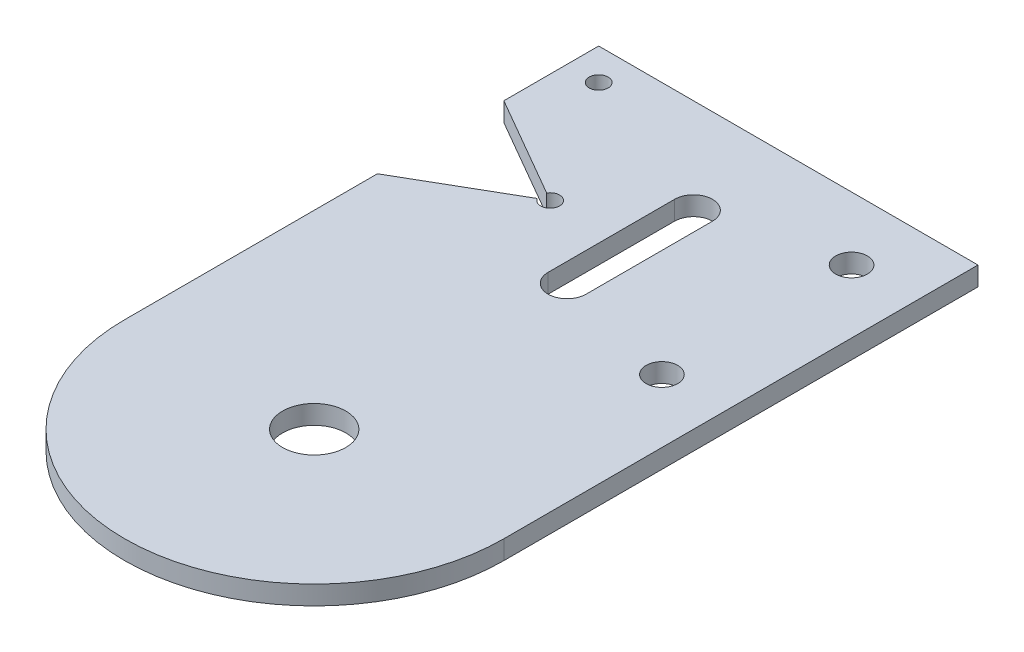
ISO-10303-21;
HEADER;
FILE_DESCRIPTION(('STEP AP214'),'2;1');
FILE_NAME('part.step','',(''),(''),'','','');
FILE_SCHEMA(('AUTOMOTIVE_DESIGN { 1 0 10303 214 1 1 1 1 }'));
ENDSEC;
DATA;
#1=APPLICATION_CONTEXT('core data for automotive mechanical design processes');
#2=APPLICATION_PROTOCOL_DEFINITION('international standard','automotive_design',2000,#1);
#3=PRODUCT_CONTEXT('',#1,'mechanical');
#4=PRODUCT('Part','Part','',(#3));
#5=PRODUCT_RELATED_PRODUCT_CATEGORY('part','',(#4));
#6=PRODUCT_DEFINITION_FORMATION('','',#4);
#7=PRODUCT_DEFINITION_CONTEXT('part definition',#1,'design');
#8=PRODUCT_DEFINITION('design','',#6,#7);
#9=PRODUCT_DEFINITION_SHAPE('','',#8);
#10=(LENGTH_UNIT() NAMED_UNIT(*) SI_UNIT(.MILLI.,.METRE.));
#11=(NAMED_UNIT(*) PLANE_ANGLE_UNIT() SI_UNIT($,.RADIAN.));
#12=(NAMED_UNIT(*) SI_UNIT($,.STERADIAN.) SOLID_ANGLE_UNIT());
#13=UNCERTAINTY_MEASURE_WITH_UNIT(LENGTH_MEASURE(1.E-05),#10,'distance_accuracy_value','');
#14=(GEOMETRIC_REPRESENTATION_CONTEXT(3) GLOBAL_UNCERTAINTY_ASSIGNED_CONTEXT((#13)) GLOBAL_UNIT_ASSIGNED_CONTEXT((#10,
#11,#12)) REPRESENTATION_CONTEXT('',''));
#15=CARTESIAN_POINT('',(0.,0.,0.));
#16=DIRECTION('',(0.,0.,1.));
#17=DIRECTION('',(1.,0.,0.));
#18=AXIS2_PLACEMENT_3D('',#15,#16,#17);
#19=CARTESIAN_POINT('',(17.3205080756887,3.,-80.));
#20=DIRECTION('',(0.,1.,0.));
#21=DIRECTION('',(0.,0.,1.));
#22=AXIS2_PLACEMENT_3D('',#19,#20,#21);
#23=PLANE('',#22);
#24=CARTESIAN_POINT('',(50.,3.,-95.));
#25=DIRECTION('',(0.,1.,0.));
#26=DIRECTION('',(0.,0.,1.));
#27=AXIS2_PLACEMENT_3D('',#24,#25,#26);
#28=CIRCLE('',#27,2.5);
#29=CARTESIAN_POINT('',(50.,3.,-92.5));
#30=VERTEX_POINT('',#29);
#31=EDGE_CURVE('E321',#30,#30,#28,.T.);
#32=ORIENTED_EDGE('',*,*,#31,.F.);
#33=EDGE_LOOP('',(#32));
#34=FACE_BOUND('',#33,.T.);
#35=CARTESIAN_POINT('',(30.,3.,-30.));
#36=DIRECTION('',(0.,1.,0.));
#37=DIRECTION('',(0.,0.,1.));
#38=AXIS2_PLACEMENT_3D('',#35,#36,#37);
#39=CIRCLE('',#38,5.);
#40=CARTESIAN_POINT('',(30.,3.,-25.));
#41=VERTEX_POINT('',#40);
#42=EDGE_CURVE('E143',#41,#41,#39,.T.);
#43=ORIENTED_EDGE('',*,*,#42,.F.);
#44=EDGE_LOOP('',(#43));
#45=FACE_BOUND('',#44,.T.);
#46=DIRECTION('',(0.,0.,-1.));
#47=VECTOR('',#46,1.);
#48=CARTESIAN_POINT('',(60.,3.,-30.));
#49=LINE('',#48,#47);
#50=CARTESIAN_POINT('',(60.,3.,-30.));
#51=VERTEX_POINT('',#50);
#52=CARTESIAN_POINT('',(60.,3.,-105.));
#53=VERTEX_POINT('',#52);
#54=EDGE_CURVE('E179',#51,#53,#49,.T.);
#55=ORIENTED_EDGE('',*,*,#54,.T.);
#56=DIRECTION('',(-1.,0.,0.));
#57=VECTOR('',#56,1.);
#58=CARTESIAN_POINT('',(0.,3.,-105.));
#59=LINE('',#58,#57);
#60=CARTESIAN_POINT('',(0.,3.,-105.));
#61=VERTEX_POINT('',#60);
#62=EDGE_CURVE('E182',#53,#61,#59,.T.);
#63=ORIENTED_EDGE('',*,*,#62,.T.);
#64=DIRECTION('',(0.,0.,1.));
#65=VECTOR('',#64,1.);
#66=CARTESIAN_POINT('',(0.,3.,-90.));
#67=LINE('',#66,#65);
#68=CARTESIAN_POINT('',(0.,3.,-90.));
#69=VERTEX_POINT('',#68);
#70=EDGE_CURVE('E184',#61,#69,#67,.T.);
#71=ORIENTED_EDGE('',*,*,#70,.T.);
#72=DIRECTION('',(0.866025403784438,0.,0.500000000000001));
#73=VECTOR('',#72,1.);
#74=CARTESIAN_POINT('',(0.,3.,-90.));
#75=LINE('',#74,#73);
#76=CARTESIAN_POINT('',(16.0214699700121,3.,-80.75));
#77=VERTEX_POINT('',#76);
#78=EDGE_CURVE('E186',#69,#77,#75,.T.);
#79=ORIENTED_EDGE('',*,*,#78,.T.);
#80=CARTESIAN_POINT('',(17.3205080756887,3.,-80.));
#81=DIRECTION('',(0.,-1.,0.));
#82=DIRECTION('',(0.,0.,1.));
#83=AXIS2_PLACEMENT_3D('',#80,#81,#82);
#84=CIRCLE('',#83,1.49999999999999);
#85=CARTESIAN_POINT('',(16.0214699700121,3.,-79.25));
#86=VERTEX_POINT('',#85);
#87=EDGE_CURVE('E188',#77,#86,#84,.T.);
#88=ORIENTED_EDGE('',*,*,#87,.T.);
#89=DIRECTION('',(-0.866025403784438,0.,0.500000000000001));
#90=VECTOR('',#89,1.);
#91=CARTESIAN_POINT('',(0.,3.,-70.));
#92=LINE('',#91,#90);
#93=CARTESIAN_POINT('',(0.,3.,-70.));
#94=VERTEX_POINT('',#93);
#95=EDGE_CURVE('E190',#86,#94,#92,.T.);
#96=ORIENTED_EDGE('',*,*,#95,.T.);
#97=DIRECTION('',(0.,0.,1.));
#98=VECTOR('',#97,1.);
#99=CARTESIAN_POINT('',(0.,3.,-30.));
#100=LINE('',#99,#98);
#101=CARTESIAN_POINT('',(0.,3.,-30.));
#102=VERTEX_POINT('',#101);
#103=EDGE_CURVE('E192',#94,#102,#100,.T.);
#104=ORIENTED_EDGE('',*,*,#103,.T.);
#105=CARTESIAN_POINT('',(30.,3.,-30.));
#106=DIRECTION('',(0.,1.,0.));
#107=DIRECTION('',(0.,0.,1.));
#108=AXIS2_PLACEMENT_3D('',#105,#106,#107);
#109=CIRCLE('',#108,30.);
#110=EDGE_CURVE('E194',#102,#51,#109,.T.);
#111=ORIENTED_EDGE('',*,*,#110,.T.);
#112=EDGE_LOOP('',(#55,#63,#71,#79,#88,#96,#104,#111));
#113=FACE_BOUND('',#112,.T.);
#114=DIRECTION('',(0.,0.,1.));
#115=VECTOR('',#114,1.);
#116=CARTESIAN_POINT('',(27.,3.,-70.));
#117=LINE('',#116,#115);
#118=CARTESIAN_POINT('',(27.,3.,-90.));
#119=VERTEX_POINT('',#118);
#120=CARTESIAN_POINT('',(27.,3.,-70.));
#121=VERTEX_POINT('',#120);
#122=EDGE_CURVE('E153',#119,#121,#117,.T.);
#123=ORIENTED_EDGE('',*,*,#122,.F.);
#124=CARTESIAN_POINT('',(30.,3.,-90.));
#125=DIRECTION('',(0.,1.,0.));
#126=DIRECTION('',(0.,0.,1.));
#127=AXIS2_PLACEMENT_3D('',#124,#125,#126);
#128=CIRCLE('',#127,3.);
#129=CARTESIAN_POINT('',(33.,3.,-90.));
#130=VERTEX_POINT('',#129);
#131=EDGE_CURVE('E136',#130,#119,#128,.T.);
#132=ORIENTED_EDGE('',*,*,#131,.F.);
#133=DIRECTION('',(0.,0.,-1.));
#134=VECTOR('',#133,1.);
#135=CARTESIAN_POINT('',(33.,3.,-70.));
#136=LINE('',#135,#134);
#137=CARTESIAN_POINT('',(33.,3.,-70.));
#138=VERTEX_POINT('',#137);
#139=EDGE_CURVE('E157',#138,#130,#136,.T.);
#140=ORIENTED_EDGE('',*,*,#139,.F.);
#141=CARTESIAN_POINT('',(30.,3.,-70.));
#142=DIRECTION('',(0.,1.,0.));
#143=DIRECTION('',(0.,0.,1.));
#144=AXIS2_PLACEMENT_3D('',#141,#142,#143);
#145=CIRCLE('',#144,3.);
#146=EDGE_CURVE('E155',#121,#138,#145,.T.);
#147=ORIENTED_EDGE('',*,*,#146,.F.);
#148=EDGE_LOOP('',(#123,#132,#140,#147));
#149=FACE_BOUND('',#148,.T.);
#150=CARTESIAN_POINT('',(5.,3.,-100.));
#151=DIRECTION('',(0.,1.,0.));
#152=DIRECTION('',(0.,0.,1.));
#153=AXIS2_PLACEMENT_3D('',#150,#151,#152);
#154=CIRCLE('',#153,1.5);
#155=CARTESIAN_POINT('',(5.,3.,-98.5));
#156=VERTEX_POINT('',#155);
#157=EDGE_CURVE('E327',#156,#156,#154,.T.);
#158=ORIENTED_EDGE('',*,*,#157,.F.);
#159=EDGE_LOOP('',(#158));
#160=FACE_BOUND('',#159,.T.);
#161=CARTESIAN_POINT('',(50.,3.,-65.));
#162=DIRECTION('',(0.,1.,0.));
#163=DIRECTION('',(0.,0.,1.));
#164=AXIS2_PLACEMENT_3D('',#161,#162,#163);
#165=CIRCLE('',#164,2.5);
#166=CARTESIAN_POINT('',(50.,3.,-62.5));
#167=VERTEX_POINT('',#166);
#168=EDGE_CURVE('E310',#167,#167,#165,.T.);
#169=ORIENTED_EDGE('',*,*,#168,.F.);
#170=EDGE_LOOP('',(#169));
#171=FACE_BOUND('',#170,.T.);
#172=ADVANCED_FACE('F32',(#34,#45,#113,#149,#160,#171),#23,.T.);
#173=CARTESIAN_POINT('',(17.3205080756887,0.,-80.));
#174=DIRECTION('',(0.,1.,0.));
#175=DIRECTION('',(0.,0.,1.));
#176=AXIS2_PLACEMENT_3D('',#173,#174,#175);
#177=PLANE('',#176);
#178=CARTESIAN_POINT('',(50.,0.,-95.));
#179=DIRECTION('',(0.,1.,0.));
#180=DIRECTION('',(0.,0.,1.));
#181=AXIS2_PLACEMENT_3D('',#178,#179,#180);
#182=CIRCLE('',#181,2.5);
#183=CARTESIAN_POINT('',(50.,0.,-92.5));
#184=VERTEX_POINT('',#183);
#185=EDGE_CURVE('E316',#184,#184,#182,.T.);
#186=ORIENTED_EDGE('',*,*,#185,.T.);
#187=EDGE_LOOP('',(#186));
#188=FACE_BOUND('',#187,.T.);
#189=CARTESIAN_POINT('',(30.,0.,-30.));
#190=DIRECTION('',(0.,1.,0.));
#191=DIRECTION('',(0.,0.,1.));
#192=AXIS2_PLACEMENT_3D('',#189,#190,#191);
#193=CIRCLE('',#192,5.);
#194=CARTESIAN_POINT('',(30.,0.,-25.));
#195=VERTEX_POINT('',#194);
#196=EDGE_CURVE('E146',#195,#195,#193,.T.);
#197=ORIENTED_EDGE('',*,*,#196,.T.);
#198=EDGE_LOOP('',(#197));
#199=FACE_BOUND('',#198,.T.);
#200=DIRECTION('',(0.,0.,-1.));
#201=VECTOR('',#200,1.);
#202=CARTESIAN_POINT('',(60.,0.,-30.));
#203=LINE('',#202,#201);
#204=CARTESIAN_POINT('',(60.,0.,-30.));
#205=VERTEX_POINT('',#204);
#206=CARTESIAN_POINT('',(60.,0.,-105.));
#207=VERTEX_POINT('',#206);
#208=EDGE_CURVE('E137',#205,#207,#203,.T.);
#209=ORIENTED_EDGE('',*,*,#208,.F.);
#210=CARTESIAN_POINT('',(30.,0.,-30.));
#211=DIRECTION('',(0.,1.,0.));
#212=DIRECTION('',(0.,0.,1.));
#213=AXIS2_PLACEMENT_3D('',#210,#211,#212);
#214=CIRCLE('',#213,30.);
#215=CARTESIAN_POINT('',(0.,0.,-30.));
#216=VERTEX_POINT('',#215);
#217=EDGE_CURVE('E177',#216,#205,#214,.T.);
#218=ORIENTED_EDGE('',*,*,#217,.F.);
#219=DIRECTION('',(0.,0.,1.));
#220=VECTOR('',#219,1.);
#221=CARTESIAN_POINT('',(0.,0.,-30.));
#222=LINE('',#221,#220);
#223=CARTESIAN_POINT('',(0.,0.,-70.));
#224=VERTEX_POINT('',#223);
#225=EDGE_CURVE('E175',#224,#216,#222,.T.);
#226=ORIENTED_EDGE('',*,*,#225,.F.);
#227=DIRECTION('',(-0.866025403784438,0.,0.500000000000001));
#228=VECTOR('',#227,1.);
#229=CARTESIAN_POINT('',(0.,0.,-70.));
#230=LINE('',#229,#228);
#231=CARTESIAN_POINT('',(16.0214699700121,0.,-79.25));
#232=VERTEX_POINT('',#231);
#233=EDGE_CURVE('E173',#232,#224,#230,.T.);
#234=ORIENTED_EDGE('',*,*,#233,.F.);
#235=CARTESIAN_POINT('',(17.3205080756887,0.,-80.));
#236=DIRECTION('',(0.,-1.,0.));
#237=DIRECTION('',(0.,0.,1.));
#238=AXIS2_PLACEMENT_3D('',#235,#236,#237);
#239=CIRCLE('',#238,1.49999999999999);
#240=CARTESIAN_POINT('',(16.0214699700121,0.,-80.75));
#241=VERTEX_POINT('',#240);
#242=EDGE_CURVE('E171',#241,#232,#239,.T.);
#243=ORIENTED_EDGE('',*,*,#242,.F.);
#244=DIRECTION('',(0.866025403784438,0.,0.500000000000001));
#245=VECTOR('',#244,1.);
#246=CARTESIAN_POINT('',(0.,0.,-90.));
#247=LINE('',#246,#245);
#248=CARTESIAN_POINT('',(0.,0.,-90.));
#249=VERTEX_POINT('',#248);
#250=EDGE_CURVE('E169',#249,#241,#247,.T.);
#251=ORIENTED_EDGE('',*,*,#250,.F.);
#252=DIRECTION('',(0.,0.,1.));
#253=VECTOR('',#252,1.);
#254=CARTESIAN_POINT('',(0.,0.,-90.));
#255=LINE('',#254,#253);
#256=CARTESIAN_POINT('',(0.,0.,-105.));
#257=VERTEX_POINT('',#256);
#258=EDGE_CURVE('E167',#257,#249,#255,.T.);
#259=ORIENTED_EDGE('',*,*,#258,.F.);
#260=DIRECTION('',(-1.,0.,0.));
#261=VECTOR('',#260,1.);
#262=CARTESIAN_POINT('',(0.,0.,-105.));
#263=LINE('',#262,#261);
#264=EDGE_CURVE('E165',#207,#257,#263,.T.);
#265=ORIENTED_EDGE('',*,*,#264,.F.);
#266=EDGE_LOOP('',(#209,#218,#226,#234,#243,#251,#259,#265));
#267=FACE_BOUND('',#266,.T.);
#268=CARTESIAN_POINT('',(30.,0.,-90.));
#269=DIRECTION('',(0.,1.,0.));
#270=DIRECTION('',(0.,0.,1.));
#271=AXIS2_PLACEMENT_3D('',#268,#269,#270);
#272=CIRCLE('',#271,3.);
#273=CARTESIAN_POINT('',(33.,0.,-90.));
#274=VERTEX_POINT('',#273);
#275=CARTESIAN_POINT('',(27.,0.,-90.));
#276=VERTEX_POINT('',#275);
#277=EDGE_CURVE('E55',#274,#276,#272,.T.);
#278=ORIENTED_EDGE('',*,*,#277,.T.);
#279=DIRECTION('',(0.,0.,1.));
#280=VECTOR('',#279,1.);
#281=CARTESIAN_POINT('',(27.,0.,-70.));
#282=LINE('',#281,#280);
#283=CARTESIAN_POINT('',(27.,0.,-70.));
#284=VERTEX_POINT('',#283);
#285=EDGE_CURVE('E123',#276,#284,#282,.T.);
#286=ORIENTED_EDGE('',*,*,#285,.T.);
#287=CARTESIAN_POINT('',(30.,0.,-70.));
#288=DIRECTION('',(0.,1.,0.));
#289=DIRECTION('',(0.,0.,1.));
#290=AXIS2_PLACEMENT_3D('',#287,#288,#289);
#291=CIRCLE('',#290,3.);
#292=CARTESIAN_POINT('',(33.,0.,-70.));
#293=VERTEX_POINT('',#292);
#294=EDGE_CURVE('E132',#284,#293,#291,.T.);
#295=ORIENTED_EDGE('',*,*,#294,.T.);
#296=DIRECTION('',(0.,0.,-1.));
#297=VECTOR('',#296,1.);
#298=CARTESIAN_POINT('',(33.,0.,-70.));
#299=LINE('',#298,#297);
#300=EDGE_CURVE('E142',#293,#274,#299,.T.);
#301=ORIENTED_EDGE('',*,*,#300,.T.);
#302=EDGE_LOOP('',(#278,#286,#295,#301));
#303=FACE_BOUND('',#302,.T.);
#304=CARTESIAN_POINT('',(5.,0.,-100.));
#305=DIRECTION('',(0.,1.,0.));
#306=DIRECTION('',(0.,0.,1.));
#307=AXIS2_PLACEMENT_3D('',#304,#305,#306);
#308=CIRCLE('',#307,1.5);
#309=CARTESIAN_POINT('',(5.,0.,-98.5));
#310=VERTEX_POINT('',#309);
#311=EDGE_CURVE('E324',#310,#310,#308,.T.);
#312=ORIENTED_EDGE('',*,*,#311,.T.);
#313=EDGE_LOOP('',(#312));
#314=FACE_BOUND('',#313,.T.);
#315=CARTESIAN_POINT('',(50.,0.,-65.));
#316=DIRECTION('',(0.,1.,0.));
#317=DIRECTION('',(0.,0.,1.));
#318=AXIS2_PLACEMENT_3D('',#315,#316,#317);
#319=CIRCLE('',#318,2.5);
#320=CARTESIAN_POINT('',(50.,0.,-62.5));
#321=VERTEX_POINT('',#320);
#322=EDGE_CURVE('E313',#321,#321,#319,.T.);
#323=ORIENTED_EDGE('',*,*,#322,.T.);
#324=EDGE_LOOP('',(#323));
#325=FACE_BOUND('',#324,.T.);
#326=ADVANCED_FACE('F140',(#188,#199,#267,#303,#314,#325),#177,.F.);
#327=CARTESIAN_POINT('',(60.,3.,-30.));
#328=DIRECTION('',(-1.,0.,0.));
#329=DIRECTION('',(0.,0.,1.));
#330=AXIS2_PLACEMENT_3D('',#327,#328,#329);
#331=PLANE('',#330);
#332=ORIENTED_EDGE('',*,*,#208,.T.);
#333=DIRECTION('',(0.,-1.,0.));
#334=VECTOR('',#333,1.);
#335=CARTESIAN_POINT('',(60.,3.,-105.));
#336=LINE('',#335,#334);
#337=EDGE_CURVE('E11',#53,#207,#336,.T.);
#338=ORIENTED_EDGE('',*,*,#337,.F.);
#339=ORIENTED_EDGE('',*,*,#54,.F.);
#340=DIRECTION('',(0.,-1.,0.));
#341=VECTOR('',#340,1.);
#342=CARTESIAN_POINT('',(60.,3.,-30.));
#343=LINE('',#342,#341);
#344=EDGE_CURVE('E196',#51,#205,#343,.T.);
#345=ORIENTED_EDGE('',*,*,#344,.T.);
#346=EDGE_LOOP('',(#332,#338,#339,#345));
#347=FACE_BOUND('',#346,.T.);
#348=ADVANCED_FACE('F34',(#347),#331,.F.);
#349=CARTESIAN_POINT('',(0.,3.,-105.));
#350=DIRECTION('',(0.,0.,1.));
#351=DIRECTION('',(1.,0.,0.));
#352=AXIS2_PLACEMENT_3D('',#349,#350,#351);
#353=PLANE('',#352);
#354=ORIENTED_EDGE('',*,*,#264,.T.);
#355=DIRECTION('',(0.,-1.,0.));
#356=VECTOR('',#355,1.);
#357=CARTESIAN_POINT('',(0.,3.,-105.));
#358=LINE('',#357,#356);
#359=EDGE_CURVE('E40',#61,#257,#358,.T.);
#360=ORIENTED_EDGE('',*,*,#359,.F.);
#361=ORIENTED_EDGE('',*,*,#62,.F.);
#362=ORIENTED_EDGE('',*,*,#337,.T.);
#363=EDGE_LOOP('',(#354,#360,#361,#362));
#364=FACE_BOUND('',#363,.T.);
#365=ADVANCED_FACE('F240',(#364),#353,.F.);
#366=CARTESIAN_POINT('',(0.,3.,-90.));
#367=DIRECTION('',(1.,0.,0.));
#368=DIRECTION('',(0.,0.,-1.));
#369=AXIS2_PLACEMENT_3D('',#366,#367,#368);
#370=PLANE('',#369);
#371=ORIENTED_EDGE('',*,*,#258,.T.);
#372=DIRECTION('',(0.,-1.,0.));
#373=VECTOR('',#372,1.);
#374=CARTESIAN_POINT('',(0.,3.,-90.));
#375=LINE('',#374,#373);
#376=EDGE_CURVE('E211',#69,#249,#375,.T.);
#377=ORIENTED_EDGE('',*,*,#376,.F.);
#378=ORIENTED_EDGE('',*,*,#70,.F.);
#379=ORIENTED_EDGE('',*,*,#359,.T.);
#380=EDGE_LOOP('',(#371,#377,#378,#379));
#381=FACE_BOUND('',#380,.T.);
#382=ADVANCED_FACE('F218',(#381),#370,.F.);
#383=CARTESIAN_POINT('',(0.,3.,-90.));
#384=DIRECTION('',(0.500000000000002,0.,-0.866025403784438));
#385=DIRECTION('',(-0.866025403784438,0.,-0.500000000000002));
#386=AXIS2_PLACEMENT_3D('',#383,#384,#385);
#387=PLANE('',#386);
#388=ORIENTED_EDGE('',*,*,#250,.T.);
#389=DIRECTION('',(0.,-1.,0.));
#390=VECTOR('',#389,1.);
#391=CARTESIAN_POINT('',(16.0214699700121,3.,-80.75));
#392=LINE('',#391,#390);
#393=EDGE_CURVE('E208',#77,#241,#392,.T.);
#394=ORIENTED_EDGE('',*,*,#393,.F.);
#395=ORIENTED_EDGE('',*,*,#78,.F.);
#396=ORIENTED_EDGE('',*,*,#376,.T.);
#397=EDGE_LOOP('',(#388,#394,#395,#396));
#398=FACE_BOUND('',#397,.T.);
#399=ADVANCED_FACE('F228',(#398),#387,.F.);
#400=CARTESIAN_POINT('',(17.3205080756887,3.,-80.));
#401=DIRECTION('',(0.,-1.,0.));
#402=DIRECTION('',(0.,0.,-1.));
#403=AXIS2_PLACEMENT_3D('',#400,#401,#402);
#404=CYLINDRICAL_SURFACE('',#403,1.49999999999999);
#405=ORIENTED_EDGE('',*,*,#242,.T.);
#406=DIRECTION('',(0.,-1.,0.));
#407=VECTOR('',#406,1.);
#408=CARTESIAN_POINT('',(16.0214699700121,3.,-79.25));
#409=LINE('',#408,#407);
#410=EDGE_CURVE('E205',#86,#232,#409,.T.);
#411=ORIENTED_EDGE('',*,*,#410,.F.);
#412=ORIENTED_EDGE('',*,*,#87,.F.);
#413=ORIENTED_EDGE('',*,*,#393,.T.);
#414=EDGE_LOOP('',(#405,#411,#412,#413));
#415=FACE_BOUND('',#414,.T.);
#416=ADVANCED_FACE('F232',(#415),#404,.F.);
#417=CARTESIAN_POINT('',(0.,3.,-70.));
#418=DIRECTION('',(0.500000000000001,0.,0.866025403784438));
#419=DIRECTION('',(0.866025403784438,0.,-0.500000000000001));
#420=AXIS2_PLACEMENT_3D('',#417,#418,#419);
#421=PLANE('',#420);
#422=ORIENTED_EDGE('',*,*,#233,.T.);
#423=DIRECTION('',(0.,-1.,0.));
#424=VECTOR('',#423,1.);
#425=CARTESIAN_POINT('',(0.,3.,-70.));
#426=LINE('',#425,#424);
#427=EDGE_CURVE('E202',#94,#224,#426,.T.);
#428=ORIENTED_EDGE('',*,*,#427,.F.);
#429=ORIENTED_EDGE('',*,*,#95,.F.);
#430=ORIENTED_EDGE('',*,*,#410,.T.);
#431=EDGE_LOOP('',(#422,#428,#429,#430));
#432=FACE_BOUND('',#431,.T.);
#433=ADVANCED_FACE('F253',(#432),#421,.F.);
#434=CARTESIAN_POINT('',(0.,3.,-30.));
#435=DIRECTION('',(1.,0.,0.));
#436=DIRECTION('',(0.,0.,-1.));
#437=AXIS2_PLACEMENT_3D('',#434,#435,#436);
#438=PLANE('',#437);
#439=ORIENTED_EDGE('',*,*,#225,.T.);
#440=DIRECTION('',(0.,-1.,0.));
#441=VECTOR('',#440,1.);
#442=CARTESIAN_POINT('',(0.,3.,-30.));
#443=LINE('',#442,#441);
#444=EDGE_CURVE('E199',#102,#216,#443,.T.);
#445=ORIENTED_EDGE('',*,*,#444,.F.);
#446=ORIENTED_EDGE('',*,*,#103,.F.);
#447=ORIENTED_EDGE('',*,*,#427,.T.);
#448=EDGE_LOOP('',(#439,#445,#446,#447));
#449=FACE_BOUND('',#448,.T.);
#450=ADVANCED_FACE('F251',(#449),#438,.F.);
#451=CARTESIAN_POINT('',(30.,3.,-30.));
#452=DIRECTION('',(0.,-1.,0.));
#453=DIRECTION('',(0.,0.,-1.));
#454=AXIS2_PLACEMENT_3D('',#451,#452,#453);
#455=CYLINDRICAL_SURFACE('',#454,30.);
#456=ORIENTED_EDGE('',*,*,#217,.T.);
#457=ORIENTED_EDGE('',*,*,#344,.F.);
#458=ORIENTED_EDGE('',*,*,#110,.F.);
#459=ORIENTED_EDGE('',*,*,#444,.T.);
#460=EDGE_LOOP('',(#456,#457,#458,#459));
#461=FACE_BOUND('',#460,.T.);
#462=ADVANCED_FACE('F246',(#461),#455,.T.);
#463=CARTESIAN_POINT('',(30.,3.,-90.));
#464=DIRECTION('',(0.,-1.,0.));
#465=DIRECTION('',(0.,0.,-1.));
#466=AXIS2_PLACEMENT_3D('',#463,#464,#465);
#467=CYLINDRICAL_SURFACE('',#466,3.);
#468=ORIENTED_EDGE('',*,*,#277,.F.);
#469=DIRECTION('',(0.,-1.,0.));
#470=VECTOR('',#469,1.);
#471=CARTESIAN_POINT('',(33.,3.,-90.));
#472=LINE('',#471,#470);
#473=EDGE_CURVE('E159',#130,#274,#472,.T.);
#474=ORIENTED_EDGE('',*,*,#473,.F.);
#475=ORIENTED_EDGE('',*,*,#131,.T.);
#476=DIRECTION('',(0.,-1.,0.));
#477=VECTOR('',#476,1.);
#478=CARTESIAN_POINT('',(27.,3.,-90.));
#479=LINE('',#478,#477);
#480=EDGE_CURVE('E125',#119,#276,#479,.T.);
#481=ORIENTED_EDGE('',*,*,#480,.T.);
#482=EDGE_LOOP('',(#468,#474,#475,#481));
#483=FACE_BOUND('',#482,.T.);
#484=ADVANCED_FACE('F134',(#483),#467,.F.);
#485=CARTESIAN_POINT('',(27.,3.,-70.));
#486=DIRECTION('',(1.,0.,0.));
#487=DIRECTION('',(0.,0.,-1.));
#488=AXIS2_PLACEMENT_3D('',#485,#486,#487);
#489=PLANE('',#488);
#490=ORIENTED_EDGE('',*,*,#285,.F.);
#491=ORIENTED_EDGE('',*,*,#480,.F.);
#492=ORIENTED_EDGE('',*,*,#122,.T.);
#493=DIRECTION('',(0.,-1.,0.));
#494=VECTOR('',#493,1.);
#495=CARTESIAN_POINT('',(27.,3.,-70.));
#496=LINE('',#495,#494);
#497=EDGE_CURVE('E128',#121,#284,#496,.T.);
#498=ORIENTED_EDGE('',*,*,#497,.T.);
#499=EDGE_LOOP('',(#490,#491,#492,#498));
#500=FACE_BOUND('',#499,.T.);
#501=ADVANCED_FACE('F124',(#500),#489,.T.);
#502=CARTESIAN_POINT('',(30.,3.,-70.));
#503=DIRECTION('',(0.,-1.,0.));
#504=DIRECTION('',(0.,0.,-1.));
#505=AXIS2_PLACEMENT_3D('',#502,#503,#504);
#506=CYLINDRICAL_SURFACE('',#505,3.);
#507=ORIENTED_EDGE('',*,*,#294,.F.);
#508=ORIENTED_EDGE('',*,*,#497,.F.);
#509=ORIENTED_EDGE('',*,*,#146,.T.);
#510=DIRECTION('',(0.,-1.,0.));
#511=VECTOR('',#510,1.);
#512=CARTESIAN_POINT('',(33.,3.,-70.));
#513=LINE('',#512,#511);
#514=EDGE_CURVE('E47',#138,#293,#513,.T.);
#515=ORIENTED_EDGE('',*,*,#514,.T.);
#516=EDGE_LOOP('',(#507,#508,#509,#515));
#517=FACE_BOUND('',#516,.T.);
#518=ADVANCED_FACE('F281',(#517),#506,.F.);
#519=CARTESIAN_POINT('',(33.,3.,-70.));
#520=DIRECTION('',(-1.,0.,0.));
#521=DIRECTION('',(0.,0.,1.));
#522=AXIS2_PLACEMENT_3D('',#519,#520,#521);
#523=PLANE('',#522);
#524=ORIENTED_EDGE('',*,*,#300,.F.);
#525=ORIENTED_EDGE('',*,*,#514,.F.);
#526=ORIENTED_EDGE('',*,*,#139,.T.);
#527=ORIENTED_EDGE('',*,*,#473,.T.);
#528=EDGE_LOOP('',(#524,#525,#526,#527));
#529=FACE_BOUND('',#528,.T.);
#530=ADVANCED_FACE('F286',(#529),#523,.T.);
#531=CARTESIAN_POINT('',(30.,3.,-30.));
#532=DIRECTION('',(0.,-1.,0.));
#533=DIRECTION('',(0.,0.,-1.));
#534=AXIS2_PLACEMENT_3D('',#531,#532,#533);
#535=CYLINDRICAL_SURFACE('',#534,5.);
#536=ORIENTED_EDGE('',*,*,#42,.T.);
#537=EDGE_LOOP('',(#536));
#538=FACE_BOUND('',#537,.T.);
#539=ORIENTED_EDGE('',*,*,#196,.F.);
#540=EDGE_LOOP('',(#539));
#541=FACE_BOUND('',#540,.T.);
#542=ADVANCED_FACE('F290',(#538,#541),#535,.F.);
#543=CARTESIAN_POINT('',(5.,3.,-100.));
#544=DIRECTION('',(0.,-1.,0.));
#545=DIRECTION('',(0.,0.,-1.));
#546=AXIS2_PLACEMENT_3D('',#543,#544,#545);
#547=CYLINDRICAL_SURFACE('',#546,1.5);
#548=ORIENTED_EDGE('',*,*,#157,.T.);
#549=EDGE_LOOP('',(#548));
#550=FACE_BOUND('',#549,.T.);
#551=ORIENTED_EDGE('',*,*,#311,.F.);
#552=EDGE_LOOP('',(#551));
#553=FACE_BOUND('',#552,.T.);
#554=ADVANCED_FACE('F293',(#550,#553),#547,.F.);
#555=CARTESIAN_POINT('',(50.,3.,-95.));
#556=DIRECTION('',(0.,-1.,0.));
#557=DIRECTION('',(0.,0.,-1.));
#558=AXIS2_PLACEMENT_3D('',#555,#556,#557);
#559=CYLINDRICAL_SURFACE('',#558,2.5);
#560=ORIENTED_EDGE('',*,*,#31,.T.);
#561=EDGE_LOOP('',(#560));
#562=FACE_BOUND('',#561,.T.);
#563=ORIENTED_EDGE('',*,*,#185,.F.);
#564=EDGE_LOOP('',(#563));
#565=FACE_BOUND('',#564,.T.);
#566=ADVANCED_FACE('F297',(#562,#565),#559,.F.);
#567=CARTESIAN_POINT('',(50.,3.,-65.));
#568=DIRECTION('',(0.,-1.,0.));
#569=DIRECTION('',(0.,0.,-1.));
#570=AXIS2_PLACEMENT_3D('',#567,#568,#569);
#571=CYLINDRICAL_SURFACE('',#570,2.5);
#572=ORIENTED_EDGE('',*,*,#168,.T.);
#573=EDGE_LOOP('',(#572));
#574=FACE_BOUND('',#573,.T.);
#575=ORIENTED_EDGE('',*,*,#322,.F.);
#576=EDGE_LOOP('',(#575));
#577=FACE_BOUND('',#576,.T.);
#578=ADVANCED_FACE('F301',(#574,#577),#571,.F.);
#579=CLOSED_SHELL('',(#172,#326,#348,#365,#382,#399,#416,#433,#450,#462,#484,#501,#518,#530,
#542,#554,#566,#578));
#580=MANIFOLD_SOLID_BREP('B2',#579);
#581=ADVANCED_BREP_SHAPE_REPRESENTATION('',(#18,#580),#14);
#582=SHAPE_DEFINITION_REPRESENTATION(#9,#581);
ENDSEC;
END-ISO-10303-21;
